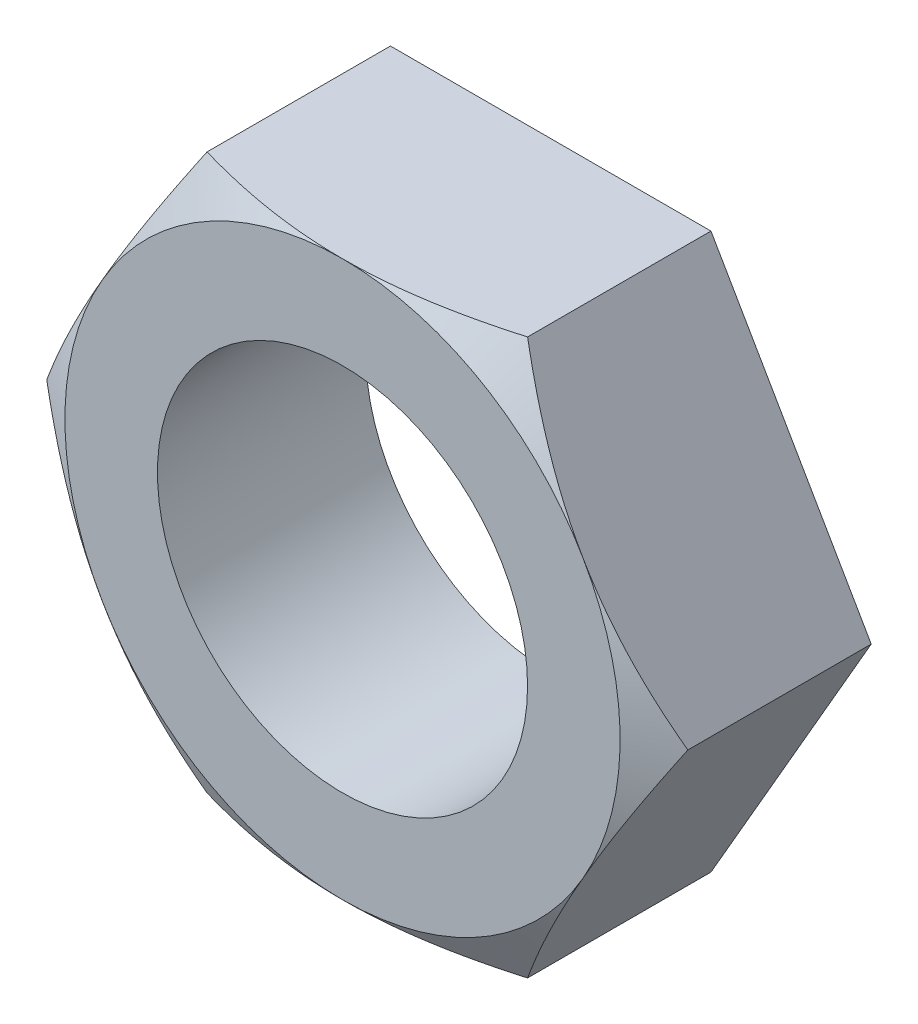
ISO-10303-21;
HEADER;
FILE_DESCRIPTION(('STEP AP214'),'2;1');
FILE_NAME('part.step','',(''),(''),'','','');
FILE_SCHEMA(('AUTOMOTIVE_DESIGN { 1 0 10303 214 1 1 1 1 }'));
ENDSEC;
DATA;
#1=APPLICATION_CONTEXT('core data for automotive mechanical design processes');
#2=APPLICATION_PROTOCOL_DEFINITION('international standard','automotive_design',2000,#1);
#3=PRODUCT_CONTEXT('',#1,'mechanical');
#4=PRODUCT('Part','Part','',(#3));
#5=PRODUCT_RELATED_PRODUCT_CATEGORY('part','',(#4));
#6=PRODUCT_DEFINITION_FORMATION('','',#4);
#7=PRODUCT_DEFINITION_CONTEXT('part definition',#1,'design');
#8=PRODUCT_DEFINITION('design','',#6,#7);
#9=PRODUCT_DEFINITION_SHAPE('','',#8);
#10=(LENGTH_UNIT() NAMED_UNIT(*) SI_UNIT(.MILLI.,.METRE.));
#11=(NAMED_UNIT(*) PLANE_ANGLE_UNIT() SI_UNIT($,.RADIAN.));
#12=(NAMED_UNIT(*) SI_UNIT($,.STERADIAN.) SOLID_ANGLE_UNIT());
#13=UNCERTAINTY_MEASURE_WITH_UNIT(LENGTH_MEASURE(1.E-05),#10,'distance_accuracy_value','');
#14=(GEOMETRIC_REPRESENTATION_CONTEXT(3) GLOBAL_UNCERTAINTY_ASSIGNED_CONTEXT((#13)) GLOBAL_UNIT_ASSIGNED_CONTEXT((#10,
#11,#12)) REPRESENTATION_CONTEXT('',''));
#15=CARTESIAN_POINT('',(0.,0.,0.));
#16=DIRECTION('',(0.,0.,1.));
#17=DIRECTION('',(1.,0.,0.));
#18=AXIS2_PLACEMENT_3D('',#15,#16,#17);
#19=CARTESIAN_POINT('',(-8.24889197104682,14.2875000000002,10.715625));
#20=DIRECTION('',(0.,0.,-1.));
#21=DIRECTION('',(-1.,0.,0.));
#22=AXIS2_PLACEMENT_3D('',#19,#20,#21);
#23=PLANE('',#22);
#24=CARTESIAN_POINT('',(0.,2.22044604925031E-13,10.715625));
#25=DIRECTION('',(0.,0.,1.));
#26=DIRECTION('',(1.,0.,0.));
#27=AXIS2_PLACEMENT_3D('',#24,#25,#26);
#28=CIRCLE('',#27,9.525);
#29=CARTESIAN_POINT('',(9.52499999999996,2.28423809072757E-13,10.715625));
#30=VERTEX_POINT('',#29);
#31=EDGE_CURVE('E174',#30,#30,#28,.T.);
#32=ORIENTED_EDGE('',*,*,#31,.F.);
#33=EDGE_LOOP('',(#32));
#34=FACE_BOUND('',#33,.T.);
#35=CARTESIAN_POINT('',(0.,2.22044604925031E-13,10.715625));
#36=DIRECTION('',(0.,0.,1.));
#37=DIRECTION('',(1.,0.,0.));
#38=AXIS2_PLACEMENT_3D('',#35,#36,#37);
#39=CIRCLE('',#38,14.2875);
#40=CARTESIAN_POINT('',(0.,14.2875000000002,10.715625));
#41=VERTEX_POINT('',#40);
#42=CARTESIAN_POINT('',(-12.3733379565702,7.14375,10.715625));
#43=VERTEX_POINT('',#42);
#44=EDGE_CURVE('E147',#41,#43,#39,.T.);
#45=ORIENTED_EDGE('',*,*,#44,.T.);
#46=CARTESIAN_POINT('',(-12.3733379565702,-7.14374999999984,10.715625));
#47=VERTEX_POINT('',#46);
#48=EDGE_CURVE('E295',#43,#47,#39,.T.);
#49=ORIENTED_EDGE('',*,*,#48,.T.);
#50=CARTESIAN_POINT('',(-1.2490009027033E-13,-14.2874999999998,10.715625));
#51=VERTEX_POINT('',#50);
#52=EDGE_CURVE('E304',#47,#51,#39,.T.);
#53=ORIENTED_EDGE('',*,*,#52,.T.);
#54=CARTESIAN_POINT('',(12.3733379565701,-7.14374999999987,10.715625));
#55=VERTEX_POINT('',#54);
#56=EDGE_CURVE('E47',#51,#55,#39,.T.);
#57=ORIENTED_EDGE('',*,*,#56,.T.);
#58=CARTESIAN_POINT('',(12.3733379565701,7.14375000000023,10.715625));
#59=VERTEX_POINT('',#58);
#60=EDGE_CURVE('E55',#55,#59,#39,.T.);
#61=ORIENTED_EDGE('',*,*,#60,.T.);
#62=EDGE_CURVE('E305',#59,#41,#39,.T.);
#63=ORIENTED_EDGE('',*,*,#62,.T.);
#64=EDGE_LOOP('',(#45,#49,#53,#57,#61,#63));
#65=FACE_BOUND('',#64,.T.);
#66=ADVANCED_FACE('F26',(#34,#65),#23,.F.);
#67=CARTESIAN_POINT('',(-16.4977839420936,1.11022302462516E-13,10.7156250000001));
#68=DIRECTION('',(0.86602540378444,-0.499999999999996,0.));
#69=DIRECTION('',(0.499999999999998,0.86602540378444,0.));
#70=AXIS2_PLACEMENT_3D('',#67,#68,#69);
#71=PLANE('',#70);
#72=CARTESIAN_POINT('',(-8.24877650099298,14.2877000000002,9.43945030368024));
#73=CARTESIAN_POINT('',(-8.43008395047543,13.9736662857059,9.54412145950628));
#74=CARTESIAN_POINT('',(-8.61209859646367,13.6584076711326,9.64404284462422));
#75=CARTESIAN_POINT('',(-8.97758743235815,13.0253624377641,9.8330657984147));
#76=CARTESIAN_POINT('',(-9.16106208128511,12.7075750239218,9.9221638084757));
#77=CARTESIAN_POINT('',(-9.52982551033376,12.0688580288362,10.0883423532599));
#78=CARTESIAN_POINT('',(-9.71511751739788,11.7479228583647,10.1653944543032));
#79=CARTESIAN_POINT('',(-10.0869890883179,11.1038224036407,10.305826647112));
#80=CARTESIAN_POINT('',(-10.2735685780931,10.7806572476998,10.36920751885));
#81=CARTESIAN_POINT('',(-10.6432342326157,10.1403775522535,10.4796014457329));
#82=CARTESIAN_POINT('',(-10.8262929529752,9.82331054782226,10.5269798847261));
#83=CARTESIAN_POINT('',(-11.19324920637,9.1877236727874,10.6064230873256));
#84=CARTESIAN_POINT('',(-11.377146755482,8.86920377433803,10.6384875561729));
#85=CARTESIAN_POINT('',(-11.745250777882,8.23162890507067,10.6864932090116));
#86=CARTESIAN_POINT('',(-11.9294566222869,7.91257502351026,10.7024535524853));
#87=CARTESIAN_POINT('',(-12.2980383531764,7.27417273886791,10.7179077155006));
#88=CARTESIAN_POINT('',(-12.4824142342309,6.95482434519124,10.7174020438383));
#89=CARTESIAN_POINT('',(-12.8271039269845,6.35780428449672,10.7010743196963));
#90=CARTESIAN_POINT('',(-12.9874423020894,6.08009007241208,10.6872438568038));
#91=CARTESIAN_POINT('',(-13.3077502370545,5.52530045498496,10.6473910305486));
#92=CARTESIAN_POINT('',(-13.467719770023,5.24822509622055,10.6213678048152));
#93=CARTESIAN_POINT('',(-13.7872031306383,4.69486368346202,10.5575831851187));
#94=CARTESIAN_POINT('',(-13.9467164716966,4.41857847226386,10.5198120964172));
#95=CARTESIAN_POINT('',(-14.2649953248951,3.86730332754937,10.4331944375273));
#96=CARTESIAN_POINT('',(-14.4237607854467,3.59231348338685,10.3843471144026));
#97=CARTESIAN_POINT('',(-14.9057021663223,2.75756652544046,10.2199559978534));
#98=CARTESIAN_POINT('',(-15.2274824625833,2.20022670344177,10.0880206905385));
#99=CARTESIAN_POINT('',(-15.8662449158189,1.09385768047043,9.78858150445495));
#100=CARTESIAN_POINT('',(-16.1832352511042,0.544814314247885,9.62114795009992));
#101=CARTESIAN_POINT('',(-16.4978994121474,-0.000199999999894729,9.43945030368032));
#102=B_SPLINE_CURVE_WITH_KNOTS('',3,(#72,#73,#74,#75,#76,#77,#78,#79,#80,#81,#82,#83,#84,#85,
#86,#87,#88,#89,#90,#91,#92,#93,#94,#95,#96,#97,#98,#99,#100,#101),.UNSPECIFIED.,.F.,.F.,(4,2,2,
2,2,2,2,2,2,2,2,2,2,2,4),(0.,1.13228866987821,2.26494862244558,3.40024304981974,
4.53547268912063,5.6426821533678,6.74991292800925,7.85582484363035,8.96170258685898,
9.92439507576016,10.8871556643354,11.850712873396,12.8143356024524,14.7839571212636,
16.7497125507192),.UNSPECIFIED.);
#103=CARTESIAN_POINT('',(-8.2488919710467,14.2875000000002,9.43951697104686));
#104=VERTEX_POINT('',#103);
#105=EDGE_CURVE('E144',#104,#43,#102,.T.);
#106=ORIENTED_EDGE('',*,*,#105,.F.);
#107=DIRECTION('',(0.,0.,-1.));
#108=VECTOR('',#107,1.);
#109=CARTESIAN_POINT('',(-8.24889197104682,14.2875000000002,10.715625));
#110=LINE('',#109,#108);
#111=CARTESIAN_POINT('',(-8.24889197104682,14.2875000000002,0.));
#112=VERTEX_POINT('',#111);
#113=EDGE_CURVE('E128',#104,#112,#110,.T.);
#114=ORIENTED_EDGE('',*,*,#113,.T.);
#115=DIRECTION('',(-0.499999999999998,-0.86602540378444,0.));
#116=VECTOR('',#115,1.);
#117=CARTESIAN_POINT('',(-16.4977839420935,1.11022302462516E-13,0.));
#118=LINE('',#117,#116);
#119=CARTESIAN_POINT('',(-16.4977839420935,1.11022302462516E-13,0.));
#120=VERTEX_POINT('',#119);
#121=EDGE_CURVE('E172',#112,#120,#118,.T.);
#122=ORIENTED_EDGE('',*,*,#121,.T.);
#123=DIRECTION('',(0.,0.,-1.));
#124=VECTOR('',#123,1.);
#125=CARTESIAN_POINT('',(-16.4977839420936,1.11022302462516E-13,10.7156250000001));
#126=LINE('',#125,#124);
#127=CARTESIAN_POINT('',(-16.4977839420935,1.11022302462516E-13,9.43951697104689));
#128=VERTEX_POINT('',#127);
#129=EDGE_CURVE('E132',#128,#120,#126,.T.);
#130=ORIENTED_EDGE('',*,*,#129,.F.);
#131=EDGE_CURVE('E155',#43,#128,#102,.T.);
#132=ORIENTED_EDGE('',*,*,#131,.F.);
#133=EDGE_LOOP('',(#106,#114,#122,#130,#132));
#134=FACE_BOUND('',#133,.T.);
#135=ADVANCED_FACE('F28',(#134),#71,.F.);
#136=CARTESIAN_POINT('',(-8.24889197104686,-14.2874999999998,10.715625));
#137=DIRECTION('',(0.86602540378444,0.499999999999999,0.));
#138=DIRECTION('',(-0.499999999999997,0.86602540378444,0.));
#139=AXIS2_PLACEMENT_3D('',#136,#137,#138);
#140=PLANE('',#139);
#141=CARTESIAN_POINT('',(-16.4978994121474,0.000200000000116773,9.43945030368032));
#142=CARTESIAN_POINT('',(-16.3165919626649,-0.313833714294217,9.54412145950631));
#143=CARTESIAN_POINT('',(-16.1345773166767,-0.629092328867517,9.64404284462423));
#144=CARTESIAN_POINT('',(-15.7690884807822,-1.26213756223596,9.83306579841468));
#145=CARTESIAN_POINT('',(-15.5856138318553,-1.57992497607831,9.92216380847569));
#146=CARTESIAN_POINT('',(-15.2168504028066,-2.21864197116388,10.0883423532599));
#147=CARTESIAN_POINT('',(-15.0315583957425,-2.53957714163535,10.1653944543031));
#148=CARTESIAN_POINT('',(-14.6596868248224,-3.18367759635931,10.305826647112));
#149=CARTESIAN_POINT('',(-14.4731073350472,-3.50684275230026,10.36920751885));
#150=CARTESIAN_POINT('',(-14.1034416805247,-4.14712244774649,10.4796014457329));
#151=CARTESIAN_POINT('',(-13.9203829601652,-4.46418945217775,10.5269798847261));
#152=CARTESIAN_POINT('',(-13.5534267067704,-5.09977632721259,10.6064230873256));
#153=CARTESIAN_POINT('',(-13.3695291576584,-5.41829622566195,10.6384875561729));
#154=CARTESIAN_POINT('',(-13.0014251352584,-6.0558710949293,10.6864932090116));
#155=CARTESIAN_POINT('',(-12.8172192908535,-6.3749249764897,10.7024535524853));
#156=CARTESIAN_POINT('',(-12.448637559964,-7.01332726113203,10.7179077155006));
#157=CARTESIAN_POINT('',(-12.2642616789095,-7.33267565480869,10.7174020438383));
#158=CARTESIAN_POINT('',(-11.9195719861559,-7.9296957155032,10.7010743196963));
#159=CARTESIAN_POINT('',(-11.759233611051,-8.20740992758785,10.6872438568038));
#160=CARTESIAN_POINT('',(-11.4389256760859,-8.76219954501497,10.6473910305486));
#161=CARTESIAN_POINT('',(-11.2789561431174,-9.03927490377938,10.6213678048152));
#162=CARTESIAN_POINT('',(-10.9594727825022,-9.59263631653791,10.5575831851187));
#163=CARTESIAN_POINT('',(-10.7999594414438,-9.86892152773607,10.5198120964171));
#164=CARTESIAN_POINT('',(-10.4816805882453,-10.4201966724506,10.4331944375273));
#165=CARTESIAN_POINT('',(-10.3229151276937,-10.6951865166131,10.3843471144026));
#166=CARTESIAN_POINT('',(-9.84097374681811,-11.5299334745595,10.2199559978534));
#167=CARTESIAN_POINT('',(-9.51919345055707,-12.0872732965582,10.0880206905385));
#168=CARTESIAN_POINT('',(-8.88043099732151,-13.1936423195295,9.78858150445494));
#169=CARTESIAN_POINT('',(-8.56344066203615,-13.742685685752,9.62114795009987));
#170=CARTESIAN_POINT('',(-8.24877650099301,-14.2876999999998,9.43945030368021));
#171=B_SPLINE_CURVE_WITH_KNOTS('',3,(#141,#142,#143,#144,#145,#146,#147,#148,#149,#150,#151,
#152,#153,#154,#155,#156,#157,#158,#159,#160,#161,#162,#163,#164,#165,#166,#167,#168,#169,#170),
.UNSPECIFIED.,.F.,.F.,(4,2,2,2,2,2,2,2,2,2,2,2,2,2,4),(0.,1.13228866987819,2.26494862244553,
3.40024304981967,4.53547268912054,5.64268215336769,6.74991292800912,7.8558248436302,
8.96170258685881,9.92439507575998,10.8871556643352,11.8507128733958,12.8143356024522,
14.7839571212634,16.749712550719),.UNSPECIFIED.);
#172=EDGE_CURVE('E182',#128,#47,#171,.T.);
#173=ORIENTED_EDGE('',*,*,#172,.F.);
#174=ORIENTED_EDGE('',*,*,#129,.T.);
#175=DIRECTION('',(0.499999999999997,-0.86602540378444,0.));
#176=VECTOR('',#175,1.);
#177=CARTESIAN_POINT('',(-8.24889197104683,-14.2874999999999,0.));
#178=LINE('',#177,#176);
#179=CARTESIAN_POINT('',(-8.24889197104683,-14.2874999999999,0.));
#180=VERTEX_POINT('',#179);
#181=EDGE_CURVE('E170',#120,#180,#178,.T.);
#182=ORIENTED_EDGE('',*,*,#181,.T.);
#183=DIRECTION('',(0.,0.,-1.));
#184=VECTOR('',#183,1.);
#185=CARTESIAN_POINT('',(-8.24889197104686,-14.2874999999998,10.715625));
#186=LINE('',#185,#184);
#187=CARTESIAN_POINT('',(-8.24889197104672,-14.2874999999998,9.43951697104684));
#188=VERTEX_POINT('',#187);
#189=EDGE_CURVE('E126',#188,#180,#186,.T.);
#190=ORIENTED_EDGE('',*,*,#189,.F.);
#191=EDGE_CURVE('E183',#47,#188,#171,.T.);
#192=ORIENTED_EDGE('',*,*,#191,.F.);
#193=EDGE_LOOP('',(#173,#174,#182,#190,#192));
#194=FACE_BOUND('',#193,.T.);
#195=ADVANCED_FACE('F218',(#194),#140,.F.);
#196=CARTESIAN_POINT('',(8.2488919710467,-14.2874999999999,10.715625));
#197=DIRECTION('',(0.,1.,0.));
#198=DIRECTION('',(0.,0.,1.));
#199=AXIS2_PLACEMENT_3D('',#196,#197,#198);
#200=PLANE('',#199);
#201=CARTESIAN_POINT('',(-21.8772771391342,-14.2874999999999,3.87867469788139));
#202=CARTESIAN_POINT('',(-21.5636377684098,-14.2874999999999,4.0302833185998));
#203=CARTESIAN_POINT('',(-21.249619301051,-14.2874999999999,4.18110729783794));
#204=CARTESIAN_POINT('',(-20.6207440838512,-14.2874999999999,4.48100586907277));
#205=CARTESIAN_POINT('',(-20.3058873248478,-14.2874999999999,4.6300804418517));
#206=CARTESIAN_POINT('',(-19.3598472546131,-14.2874999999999,5.07445309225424));
#207=CARTESIAN_POINT('',(-18.7272961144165,-14.2874999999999,5.36685067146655));
#208=CARTESIAN_POINT('',(-17.4542030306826,-14.2874999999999,5.9436965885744));
#209=CARTESIAN_POINT('',(-16.8136360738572,-14.2874999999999,6.22808986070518));
#210=CARTESIAN_POINT('',(-15.5272379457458,-14.2874999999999,6.78466588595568));
#211=CARTESIAN_POINT('',(-14.8814070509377,-14.2874999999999,7.05684927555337));
#212=CARTESIAN_POINT('',(-13.5754366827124,-14.2874999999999,7.58898224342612));
#213=CARTESIAN_POINT('',(-12.9152188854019,-14.2874999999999,7.84874060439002));
#214=CARTESIAN_POINT('',(-11.5869913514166,-14.2874999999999,8.34791402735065));
#215=CARTESIAN_POINT('',(-10.9189807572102,-14.2874999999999,8.58732682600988));
#216=CARTESIAN_POINT('',(-9.57549889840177,-14.2874999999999,9.03937293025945));
#217=CARTESIAN_POINT('',(-8.90004694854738,-14.2874999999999,9.25206316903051));
#218=CARTESIAN_POINT('',(-7.53947553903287,-14.2874999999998,9.64376711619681));
#219=CARTESIAN_POINT('',(-6.85435921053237,-14.2874999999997,9.82279147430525));
#220=CARTESIAN_POINT('',(-5.81930614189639,-14.2874999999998,10.0595250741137));
#221=CARTESIAN_POINT('',(-5.47298523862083,-14.2874999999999,10.1331478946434));
#222=CARTESIAN_POINT('',(-4.778038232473,-14.2874999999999,10.2686300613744));
#223=CARTESIAN_POINT('',(-4.42941217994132,-14.2874999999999,10.3304896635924));
#224=CARTESIAN_POINT('',(-3.73008200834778,-14.2874999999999,10.4413497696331));
#225=CARTESIAN_POINT('',(-3.37937772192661,-14.2874999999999,10.4903492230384));
#226=CARTESIAN_POINT('',(-2.67631444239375,-14.2874999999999,10.5745014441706));
#227=CARTESIAN_POINT('',(-2.32395551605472,-14.2874999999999,10.609654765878));
#228=CARTESIAN_POINT('',(-1.62031244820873,-14.2874999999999,10.6651718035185));
#229=CARTESIAN_POINT('',(-1.2690356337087,-14.2874999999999,10.6856277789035));
#230=CARTESIAN_POINT('',(-0.565931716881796,-14.2874999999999,10.711641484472));
#231=CARTESIAN_POINT('',(-0.214104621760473,-14.2874999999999,10.7171994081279));
#232=CARTESIAN_POINT('',(0.48936855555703,-14.2874999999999,10.7132851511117));
#233=CARTESIAN_POINT('',(0.841014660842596,-14.2874999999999,10.7038171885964));
#234=CARTESIAN_POINT('',(1.54360125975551,-14.2874999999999,10.670086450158));
#235=CARTESIAN_POINT('',(1.89454171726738,-14.2874999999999,10.6458229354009));
#236=CARTESIAN_POINT('',(2.74511336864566,-14.2874999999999,10.5695915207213));
#237=CARTESIAN_POINT('',(3.24409106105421,-14.2874999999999,10.5102105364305));
#238=CARTESIAN_POINT('',(4.23822277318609,-14.2874999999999,10.3648341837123));
#239=CARTESIAN_POINT('',(4.73337571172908,-14.2874999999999,10.278831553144));
#240=CARTESIAN_POINT('',(5.71944950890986,-14.2874999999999,10.0832620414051));
#241=CARTESIAN_POINT('',(6.21036590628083,-14.2874999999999,9.97367287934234));
#242=CARTESIAN_POINT('',(7.18714781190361,-14.2874999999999,9.73427438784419));
#243=CARTESIAN_POINT('',(7.6730137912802,-14.2874999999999,9.60446696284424));
#244=CARTESIAN_POINT('',(8.65166193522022,-14.2874999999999,9.32434282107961));
#245=CARTESIAN_POINT('',(9.14432169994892,-14.2874999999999,9.17360137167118));
#246=CARTESIAN_POINT('',(10.1244328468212,-14.2874999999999,8.85722891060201));
#247=CARTESIAN_POINT('',(10.6118875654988,-14.2874999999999,8.69160816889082));
#248=CARTESIAN_POINT('',(11.5796371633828,-14.2874999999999,8.34887715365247));
#249=CARTESIAN_POINT('',(12.0599568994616,-14.2874999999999,8.17183679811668));
#250=CARTESIAN_POINT('',(12.7775886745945,-14.2874999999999,7.89854598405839));
#251=CARTESIAN_POINT('',(13.0163757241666,-14.2874999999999,7.80613994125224));
#252=CARTESIAN_POINT('',(13.4930210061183,-14.2874999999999,7.61897774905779));
#253=CARTESIAN_POINT('',(13.7308792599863,-14.2874999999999,7.5242216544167));
#254=CARTESIAN_POINT('',(13.9683064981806,-14.2874999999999,7.42839626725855));
#255=B_SPLINE_CURVE_WITH_KNOTS('',3,(#201,#202,#203,#204,#205,#206,#207,#208,#209,#210,#211,
#212,#213,#214,#215,#216,#217,#218,#219,#220,#221,#222,#223,#224,#225,#226,#227,#228,#229,#230,
#231,#232,#233,#234,#235,#236,#237,#238,#239,#240,#241,#242,#243,#244,#245,#246,#247,#248,#249,
#250,#251,#252,#253,#254),.UNSPECIFIED.,.F.,.F.,(4,2,2,2,2,2,2,2,2,2,2,2,2,2,2,2,2,2,2,2,2,2,2,
2,2,2,4),(0.,1.04507856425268,2.09016859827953,4.180688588,6.2831717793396,8.3855452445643,
10.513729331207,12.6421498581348,14.7659559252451,16.8890890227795,17.9511013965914,
19.0130906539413,20.0751666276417,21.1372001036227,22.1925072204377,23.2478006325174,
24.3027978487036,25.3578477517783,26.8645039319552,28.3715714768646,29.8800689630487,
31.3884244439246,32.9337529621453,34.4780229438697,36.0136007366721,36.7817204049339,
37.5498221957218),.UNSPECIFIED.);
#256=EDGE_CURVE('E214',#188,#51,#255,.T.);
#257=ORIENTED_EDGE('',*,*,#256,.F.);
#258=ORIENTED_EDGE('',*,*,#189,.T.);
#259=DIRECTION('',(1.,0.,0.));
#260=VECTOR('',#259,1.);
#261=CARTESIAN_POINT('',(8.24889197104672,-14.2874999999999,0.));
#262=LINE('',#261,#260);
#263=CARTESIAN_POINT('',(8.24889197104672,-14.2874999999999,0.));
#264=VERTEX_POINT('',#263);
#265=EDGE_CURVE('E167',#180,#264,#262,.T.);
#266=ORIENTED_EDGE('',*,*,#265,.T.);
#267=DIRECTION('',(0.,0.,-1.));
#268=VECTOR('',#267,1.);
#269=CARTESIAN_POINT('',(8.2488919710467,-14.2874999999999,10.715625));
#270=LINE('',#269,#268);
#271=CARTESIAN_POINT('',(8.24889197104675,-14.2874999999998,9.43951697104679));
#272=VERTEX_POINT('',#271);
#273=EDGE_CURVE('E123',#272,#264,#270,.T.);
#274=ORIENTED_EDGE('',*,*,#273,.F.);
#275=EDGE_CURVE('E209',#51,#272,#255,.T.);
#276=ORIENTED_EDGE('',*,*,#275,.F.);
#277=EDGE_LOOP('',(#257,#258,#266,#274,#276));
#278=FACE_BOUND('',#277,.T.);
#279=ADVANCED_FACE('F215',(#278),#200,.F.);
#280=CARTESIAN_POINT('',(16.4977839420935,1.11022302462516E-13,10.715625));
#281=DIRECTION('',(-0.86602540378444,0.499999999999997,0.));
#282=DIRECTION('',(-0.499999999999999,-0.86602540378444,0.));
#283=AXIS2_PLACEMENT_3D('',#280,#281,#282);
#284=PLANE('',#283);
#285=CARTESIAN_POINT('',(8.24877650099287,-14.2876999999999,9.43945030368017));
#286=CARTESIAN_POINT('',(8.43008395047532,-13.9736662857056,9.54412145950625));
#287=CARTESIAN_POINT('',(8.61209859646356,-13.6584076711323,9.64404284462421));
#288=CARTESIAN_POINT('',(8.97758743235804,-13.0253624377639,9.8330657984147));
#289=CARTESIAN_POINT('',(9.161062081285,-12.7075750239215,9.9221638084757));
#290=CARTESIAN_POINT('',(9.52982551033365,-12.0688580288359,10.0883423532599));
#291=CARTESIAN_POINT('',(9.71511751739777,-11.7479228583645,10.1653944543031));
#292=CARTESIAN_POINT('',(10.0869890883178,-11.1038224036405,10.305826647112));
#293=CARTESIAN_POINT('',(10.273568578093,-10.7806572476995,10.36920751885));
#294=CARTESIAN_POINT('',(10.6432342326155,-10.1403775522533,10.4796014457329));
#295=CARTESIAN_POINT('',(10.8262929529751,-9.82331054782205,10.5269798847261));
#296=CARTESIAN_POINT('',(11.1932492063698,-9.1877236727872,10.6064230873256));
#297=CARTESIAN_POINT('',(11.3771467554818,-8.86920377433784,10.6384875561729));
#298=CARTESIAN_POINT('',(11.7452507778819,-8.23162890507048,10.6864932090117));
#299=CARTESIAN_POINT('',(11.9294566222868,-7.91257502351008,10.7024535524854));
#300=CARTESIAN_POINT('',(12.2980383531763,-7.27417273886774,10.7179077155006));
#301=CARTESIAN_POINT('',(12.4824142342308,-6.95482434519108,10.7174020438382));
#302=CARTESIAN_POINT('',(12.8271039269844,-6.35780428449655,10.7010743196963));
#303=CARTESIAN_POINT('',(12.9874423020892,-6.08009007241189,10.6872438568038));
#304=CARTESIAN_POINT('',(13.3077502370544,-5.52530045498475,10.6473910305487));
#305=CARTESIAN_POINT('',(13.4677197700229,-5.24822509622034,10.6213678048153));
#306=CARTESIAN_POINT('',(13.7872031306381,-4.69486368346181,10.5575831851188));
#307=CARTESIAN_POINT('',(13.9467164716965,-4.41857847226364,10.5198120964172));
#308=CARTESIAN_POINT('',(14.264995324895,-3.86730332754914,10.4331944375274));
#309=CARTESIAN_POINT('',(14.4237607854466,-3.59231348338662,10.3843471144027));
#310=CARTESIAN_POINT('',(14.9057021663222,-2.75756652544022,10.2199559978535));
#311=CARTESIAN_POINT('',(15.2274824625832,-2.20022670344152,10.0880206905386));
#312=CARTESIAN_POINT('',(15.8662449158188,-1.09385768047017,9.78858150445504));
#313=CARTESIAN_POINT('',(16.1832352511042,-0.54481431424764,9.62114795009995));
#314=CARTESIAN_POINT('',(16.4978994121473,0.000200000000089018,9.43945030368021));
#315=B_SPLINE_CURVE_WITH_KNOTS('',3,(#285,#286,#287,#288,#289,#290,#291,#292,#293,#294,#295,
#296,#297,#298,#299,#300,#301,#302,#303,#304,#305,#306,#307,#308,#309,#310,#311,#312,#313,#314),
.UNSPECIFIED.,.F.,.F.,(4,2,2,2,2,2,2,2,2,2,2,2,2,2,4),(0.,1.13228866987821,2.26494862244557,
3.40024304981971,4.53547268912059,5.64268215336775,6.74991292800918,7.85582484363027,
8.96170258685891,9.9243950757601,10.8871556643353,11.850712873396,12.8143356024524,
14.7839571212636,16.7497125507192),.UNSPECIFIED.);
#316=EDGE_CURVE('E109',#272,#55,#315,.T.);
#317=ORIENTED_EDGE('',*,*,#316,.F.);
#318=ORIENTED_EDGE('',*,*,#273,.T.);
#319=DIRECTION('',(0.499999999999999,0.86602540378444,0.));
#320=VECTOR('',#319,1.);
#321=CARTESIAN_POINT('',(16.4977839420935,1.11022302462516E-13,0.));
#322=LINE('',#321,#320);
#323=CARTESIAN_POINT('',(16.4977839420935,1.11022302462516E-13,0.));
#324=VERTEX_POINT('',#323);
#325=EDGE_CURVE('E121',#264,#324,#322,.T.);
#326=ORIENTED_EDGE('',*,*,#325,.T.);
#327=DIRECTION('',(0.,0.,-1.));
#328=VECTOR('',#327,1.);
#329=CARTESIAN_POINT('',(16.4977839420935,1.11022302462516E-13,10.715625));
#330=LINE('',#329,#328);
#331=CARTESIAN_POINT('',(16.4977839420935,1.38777878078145E-13,9.43951697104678));
#332=VERTEX_POINT('',#331);
#333=EDGE_CURVE('E114',#332,#324,#330,.T.);
#334=ORIENTED_EDGE('',*,*,#333,.F.);
#335=EDGE_CURVE('E101',#55,#332,#315,.T.);
#336=ORIENTED_EDGE('',*,*,#335,.F.);
#337=EDGE_LOOP('',(#317,#318,#326,#334,#336));
#338=FACE_BOUND('',#337,.T.);
#339=ADVANCED_FACE('F119',(#338),#284,.F.);
#340=CARTESIAN_POINT('',(8.24889197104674,14.2875000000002,10.715625));
#341=DIRECTION('',(-0.86602540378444,-0.499999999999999,0.));
#342=DIRECTION('',(0.499999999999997,-0.86602540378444,0.));
#343=AXIS2_PLACEMENT_3D('',#340,#341,#342);
#344=PLANE('',#343);
#345=CARTESIAN_POINT('',(16.4978994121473,-0.000199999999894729,9.43945030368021));
#346=CARTESIAN_POINT('',(16.3165919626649,0.31383371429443,9.54412145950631));
#347=CARTESIAN_POINT('',(16.1345773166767,0.629092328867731,9.64404284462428));
#348=CARTESIAN_POINT('',(15.7690884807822,1.26213756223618,9.83306579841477));
#349=CARTESIAN_POINT('',(15.5856138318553,1.57992497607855,9.92216380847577));
#350=CARTESIAN_POINT('',(15.2168504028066,2.21864197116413,10.08834235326));
#351=CARTESIAN_POINT('',(15.0315583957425,2.53957714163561,10.1653944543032));
#352=CARTESIAN_POINT('',(14.6596868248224,3.18367759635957,10.3058266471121));
#353=CARTESIAN_POINT('',(14.4731073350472,3.50684275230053,10.3692075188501));
#354=CARTESIAN_POINT('',(14.1034416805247,4.14712244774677,10.479601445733));
#355=CARTESIAN_POINT('',(13.9203829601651,4.46418945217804,10.5269798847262));
#356=CARTESIAN_POINT('',(13.5534267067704,5.0997763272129,10.6064230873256));
#357=CARTESIAN_POINT('',(13.3695291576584,5.41829622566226,10.6384875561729));
#358=CARTESIAN_POINT('',(13.0014251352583,6.05587109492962,10.6864932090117));
#359=CARTESIAN_POINT('',(12.8172192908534,6.37492497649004,10.7024535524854));
#360=CARTESIAN_POINT('',(12.4486375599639,7.01332726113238,10.7179077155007));
#361=CARTESIAN_POINT('',(12.2642616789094,7.33267565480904,10.7174020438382));
#362=CARTESIAN_POINT('',(11.9195719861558,7.92969571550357,10.7010743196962));
#363=CARTESIAN_POINT('',(11.759233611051,8.20740992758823,10.6872438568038));
#364=CARTESIAN_POINT('',(11.4389256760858,8.76219954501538,10.6473910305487));
#365=CARTESIAN_POINT('',(11.2789561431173,9.03927490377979,10.6213678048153));
#366=CARTESIAN_POINT('',(10.9594727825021,9.59263631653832,10.5575831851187));
#367=CARTESIAN_POINT('',(10.7999594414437,9.86892152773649,10.5198120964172));
#368=CARTESIAN_POINT('',(10.4816805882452,10.420196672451,10.4331944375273));
#369=CARTESIAN_POINT('',(10.3229151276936,10.6951865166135,10.3843471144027));
#370=CARTESIAN_POINT('',(9.840973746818,11.5299334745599,10.2199559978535));
#371=CARTESIAN_POINT('',(9.51919345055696,12.0872732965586,10.0880206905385));
#372=CARTESIAN_POINT('',(8.88043099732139,13.1936423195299,9.78858150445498));
#373=CARTESIAN_POINT('',(8.56344066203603,13.7426856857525,9.62114795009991));
#374=CARTESIAN_POINT('',(8.2487765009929,14.2877000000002,9.43945030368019));
#375=B_SPLINE_CURVE_WITH_KNOTS('',3,(#345,#346,#347,#348,#349,#350,#351,#352,#353,#354,#355,
#356,#357,#358,#359,#360,#361,#362,#363,#364,#365,#366,#367,#368,#369,#370,#371,#372,#373,#374),
.UNSPECIFIED.,.F.,.F.,(4,2,2,2,2,2,2,2,2,2,2,2,2,2,4),(0.,1.13228866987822,2.2649486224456,
3.40024304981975,4.53547268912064,5.64268215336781,6.74991292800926,7.85582484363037,
8.96170258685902,9.92439507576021,10.8871556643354,11.8507128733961,12.8143356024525,
14.7839571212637,16.7497125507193),.UNSPECIFIED.);
#376=EDGE_CURVE('E104',#332,#59,#375,.T.);
#377=ORIENTED_EDGE('',*,*,#376,.F.);
#378=ORIENTED_EDGE('',*,*,#333,.T.);
#379=DIRECTION('',(-0.499999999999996,0.86602540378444,0.));
#380=VECTOR('',#379,1.);
#381=CARTESIAN_POINT('',(8.24889197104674,14.2875000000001,0.));
#382=LINE('',#381,#380);
#383=CARTESIAN_POINT('',(8.24889197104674,14.2875000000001,0.));
#384=VERTEX_POINT('',#383);
#385=EDGE_CURVE('E162',#324,#384,#382,.T.);
#386=ORIENTED_EDGE('',*,*,#385,.T.);
#387=DIRECTION('',(0.,0.,-1.));
#388=VECTOR('',#387,1.);
#389=CARTESIAN_POINT('',(8.24889197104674,14.2875000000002,10.715625));
#390=LINE('',#389,#388);
#391=CARTESIAN_POINT('',(8.24889197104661,14.2875000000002,9.43951697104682));
#392=VERTEX_POINT('',#391);
#393=EDGE_CURVE('E124',#392,#384,#390,.T.);
#394=ORIENTED_EDGE('',*,*,#393,.F.);
#395=EDGE_CURVE('E117',#59,#392,#375,.T.);
#396=ORIENTED_EDGE('',*,*,#395,.F.);
#397=EDGE_LOOP('',(#377,#378,#386,#394,#396));
#398=FACE_BOUND('',#397,.T.);
#399=ADVANCED_FACE('F112',(#398),#344,.F.);
#400=CARTESIAN_POINT('',(-8.24889197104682,14.2875000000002,10.715625));
#401=DIRECTION('',(0.,-1.,0.));
#402=DIRECTION('',(0.,0.,-1.));
#403=AXIS2_PLACEMENT_3D('',#400,#401,#402);
#404=PLANE('',#403);
#405=CARTESIAN_POINT('',(-21.8772771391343,14.2875000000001,3.87867469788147));
#406=CARTESIAN_POINT('',(-21.5636377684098,14.2875000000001,4.03028331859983));
#407=CARTESIAN_POINT('',(-21.2496193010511,14.2875000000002,4.18110729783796));
#408=CARTESIAN_POINT('',(-20.6207440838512,14.2875000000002,4.48100586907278));
#409=CARTESIAN_POINT('',(-20.3058873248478,14.2875000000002,4.63008044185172));
#410=CARTESIAN_POINT('',(-19.3598472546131,14.2875000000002,5.07445309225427));
#411=CARTESIAN_POINT('',(-18.7272961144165,14.2875000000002,5.36685067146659));
#412=CARTESIAN_POINT('',(-17.4542030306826,14.2875000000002,5.94369658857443));
#413=CARTESIAN_POINT('',(-16.8136360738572,14.2875000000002,6.22808986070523));
#414=CARTESIAN_POINT('',(-15.5272379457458,14.2875000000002,6.78466588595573));
#415=CARTESIAN_POINT('',(-14.8814070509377,14.2875000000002,7.05684927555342));
#416=CARTESIAN_POINT('',(-13.5754366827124,14.2875000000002,7.58898224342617));
#417=CARTESIAN_POINT('',(-12.9152188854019,14.2875000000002,7.84874060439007));
#418=CARTESIAN_POINT('',(-11.5869913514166,14.2875000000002,8.34791402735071));
#419=CARTESIAN_POINT('',(-10.9189807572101,14.2875000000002,8.58732682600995));
#420=CARTESIAN_POINT('',(-9.57549889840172,14.2875000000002,9.03937293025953));
#421=CARTESIAN_POINT('',(-8.90004694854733,14.2875000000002,9.25206316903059));
#422=CARTESIAN_POINT('',(-7.5394755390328,14.2875000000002,9.64376711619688));
#423=CARTESIAN_POINT('',(-6.85435921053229,14.2875000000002,9.82279147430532));
#424=CARTESIAN_POINT('',(-5.81930614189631,14.2875000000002,10.0595250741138));
#425=CARTESIAN_POINT('',(-5.47298523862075,14.2875000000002,10.1331478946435));
#426=CARTESIAN_POINT('',(-4.77803823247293,14.2875000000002,10.2686300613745));
#427=CARTESIAN_POINT('',(-4.42941217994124,14.2875000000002,10.3304896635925));
#428=CARTESIAN_POINT('',(-3.7300820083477,14.2875000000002,10.4413497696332));
#429=CARTESIAN_POINT('',(-3.37937772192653,14.2875000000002,10.4903492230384));
#430=CARTESIAN_POINT('',(-2.67631444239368,14.2875000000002,10.5745014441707));
#431=CARTESIAN_POINT('',(-2.32395551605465,14.2875000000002,10.6096547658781));
#432=CARTESIAN_POINT('',(-1.62031244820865,14.2875000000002,10.6651718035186));
#433=CARTESIAN_POINT('',(-1.26903563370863,14.2875000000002,10.6856277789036));
#434=CARTESIAN_POINT('',(-0.565931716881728,14.2875000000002,10.7116414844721));
#435=CARTESIAN_POINT('',(-0.214104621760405,14.2875000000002,10.717199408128));
#436=CARTESIAN_POINT('',(0.4893685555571,14.2875000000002,10.7132851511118));
#437=CARTESIAN_POINT('',(0.841014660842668,14.2875000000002,10.7038171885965));
#438=CARTESIAN_POINT('',(1.54360125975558,14.2875000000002,10.6700864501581));
#439=CARTESIAN_POINT('',(1.89454171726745,14.2875000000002,10.6458229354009));
#440=CARTESIAN_POINT('',(2.74511336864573,14.2875000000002,10.5695915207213));
#441=CARTESIAN_POINT('',(3.24409106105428,14.2875000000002,10.5102105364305));
#442=CARTESIAN_POINT('',(4.23822277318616,14.2875000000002,10.3648341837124));
#443=CARTESIAN_POINT('',(4.73337571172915,14.2875000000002,10.2788315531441));
#444=CARTESIAN_POINT('',(5.71944950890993,14.2875000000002,10.0832620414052));
#445=CARTESIAN_POINT('',(6.21036590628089,14.2875000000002,9.9736728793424));
#446=CARTESIAN_POINT('',(7.18714781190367,14.2875000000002,9.73427438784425));
#447=CARTESIAN_POINT('',(7.67301379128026,14.2875000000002,9.6044669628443));
#448=CARTESIAN_POINT('',(8.65166193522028,14.2875000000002,9.32434282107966));
#449=CARTESIAN_POINT('',(9.14432169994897,14.2875000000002,9.17360137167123));
#450=CARTESIAN_POINT('',(10.1244328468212,14.2875000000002,8.85722891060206));
#451=CARTESIAN_POINT('',(10.6118875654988,14.2875000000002,8.69160816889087));
#452=CARTESIAN_POINT('',(11.5796371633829,14.2875000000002,8.34887715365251));
#453=CARTESIAN_POINT('',(12.0599568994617,14.2875000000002,8.17183679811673));
#454=CARTESIAN_POINT('',(12.7775886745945,14.2875000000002,7.89854598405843));
#455=CARTESIAN_POINT('',(13.0163757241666,14.2875000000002,7.8061399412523));
#456=CARTESIAN_POINT('',(13.4930210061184,14.2875000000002,7.61897774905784));
#457=CARTESIAN_POINT('',(13.7308792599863,14.2875000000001,7.52422165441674));
#458=CARTESIAN_POINT('',(13.9683064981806,14.2875000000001,7.42839626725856));
#459=B_SPLINE_CURVE_WITH_KNOTS('',3,(#405,#406,#407,#408,#409,#410,#411,#412,#413,#414,#415,
#416,#417,#418,#419,#420,#421,#422,#423,#424,#425,#426,#427,#428,#429,#430,#431,#432,#433,#434,
#435,#436,#437,#438,#439,#440,#441,#442,#443,#444,#445,#446,#447,#448,#449,#450,#451,#452,#453,
#454,#455,#456,#457,#458),.UNSPECIFIED.,.F.,.F.,(4,2,2,2,2,2,2,2,2,2,2,2,2,2,2,2,2,2,2,2,2,2,2,
2,2,2,4),(0.,1.04507856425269,2.09016859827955,4.18068858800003,6.28317177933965,
8.38554524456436,10.5137293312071,12.6421498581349,14.7659559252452,16.8890890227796,
17.9511013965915,19.0130906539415,20.0751666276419,21.1372001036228,22.1925072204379,
23.2478006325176,24.3027978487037,25.3578477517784,26.8645039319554,28.3715714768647,
29.8800689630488,31.3884244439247,32.9337529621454,34.4780229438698,36.0136007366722,
36.7817204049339,37.5498221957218),.UNSPECIFIED.);
#460=EDGE_CURVE('E11',#392,#41,#459,.F.);
#461=ORIENTED_EDGE('',*,*,#460,.F.);
#462=ORIENTED_EDGE('',*,*,#393,.T.);
#463=DIRECTION('',(-1.,0.,0.));
#464=VECTOR('',#463,1.);
#465=CARTESIAN_POINT('',(-8.24889197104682,14.2875000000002,0.));
#466=LINE('',#465,#464);
#467=EDGE_CURVE('E160',#384,#112,#466,.T.);
#468=ORIENTED_EDGE('',*,*,#467,.T.);
#469=ORIENTED_EDGE('',*,*,#113,.F.);
#470=EDGE_CURVE('E31',#41,#104,#459,.F.);
#471=ORIENTED_EDGE('',*,*,#470,.F.);
#472=EDGE_LOOP('',(#461,#462,#468,#469,#471));
#473=FACE_BOUND('',#472,.T.);
#474=ADVANCED_FACE('F158',(#473),#404,.F.);
#475=CARTESIAN_POINT('',(-8.24889197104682,14.2875000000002,0.));
#476=DIRECTION('',(0.,0.,-1.));
#477=DIRECTION('',(-1.,0.,0.));
#478=AXIS2_PLACEMENT_3D('',#475,#476,#477);
#479=PLANE('',#478);
#480=ORIENTED_EDGE('',*,*,#121,.F.);
#481=ORIENTED_EDGE('',*,*,#467,.F.);
#482=ORIENTED_EDGE('',*,*,#385,.F.);
#483=ORIENTED_EDGE('',*,*,#325,.F.);
#484=ORIENTED_EDGE('',*,*,#265,.F.);
#485=ORIENTED_EDGE('',*,*,#181,.F.);
#486=EDGE_LOOP('',(#480,#481,#482,#483,#484,#485));
#487=FACE_BOUND('',#486,.T.);
#488=CARTESIAN_POINT('',(0.,1.11022302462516E-13,0.));
#489=DIRECTION('',(0.,0.,1.));
#490=DIRECTION('',(1.,0.,0.));
#491=AXIS2_PLACEMENT_3D('',#488,#489,#490);
#492=CIRCLE('',#491,9.525);
#493=CARTESIAN_POINT('',(9.525,1.17401506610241E-13,0.));
#494=VERTEX_POINT('',#493);
#495=EDGE_CURVE('E156',#494,#494,#492,.T.);
#496=ORIENTED_EDGE('',*,*,#495,.T.);
#497=EDGE_LOOP('',(#496));
#498=FACE_BOUND('',#497,.T.);
#499=ADVANCED_FACE('F233',(#487,#498),#479,.T.);
#500=CARTESIAN_POINT('',(0.,2.22044604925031E-13,10.715625));
#501=DIRECTION('',(0.,0.,-1.));
#502=DIRECTION('',(-1.,0.,0.));
#503=AXIS2_PLACEMENT_3D('',#500,#501,#502);
#504=CYLINDRICAL_SURFACE('',#503,9.525);
#505=ORIENTED_EDGE('',*,*,#31,.T.);
#506=EDGE_LOOP('',(#505));
#507=FACE_BOUND('',#506,.T.);
#508=ORIENTED_EDGE('',*,*,#495,.F.);
#509=EDGE_LOOP('',(#508));
#510=FACE_BOUND('',#509,.T.);
#511=ADVANCED_FACE('F192',(#507,#510),#504,.F.);
#512=CARTESIAN_POINT('',(0.,2.22044604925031E-13,10.715625));
#513=DIRECTION('',(0.,0.,-1.));
#514=DIRECTION('',(-1.,0.,0.));
#515=AXIS2_PLACEMENT_3D('',#512,#513,#514);
#516=CONICAL_SURFACE('',#515,14.2875,1.04719755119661);
#517=ORIENTED_EDGE('',*,*,#105,.T.);
#518=ORIENTED_EDGE('',*,*,#44,.F.);
#519=ORIENTED_EDGE('',*,*,#470,.T.);
#520=EDGE_LOOP('',(#517,#518,#519));
#521=FACE_BOUND('',#520,.T.);
#522=ADVANCED_FACE('F143',(#521),#516,.T.);
#523=ORIENTED_EDGE('',*,*,#395,.T.);
#524=ORIENTED_EDGE('',*,*,#460,.T.);
#525=ORIENTED_EDGE('',*,*,#62,.F.);
#526=EDGE_LOOP('',(#523,#524,#525));
#527=FACE_BOUND('',#526,.T.);
#528=ADVANCED_FACE('F191',(#527),#516,.T.);
#529=ORIENTED_EDGE('',*,*,#335,.T.);
#530=ORIENTED_EDGE('',*,*,#376,.T.);
#531=ORIENTED_EDGE('',*,*,#60,.F.);
#532=EDGE_LOOP('',(#529,#530,#531));
#533=FACE_BOUND('',#532,.T.);
#534=ADVANCED_FACE('F103',(#533),#516,.T.);
#535=ORIENTED_EDGE('',*,*,#275,.T.);
#536=ORIENTED_EDGE('',*,*,#316,.T.);
#537=ORIENTED_EDGE('',*,*,#56,.F.);
#538=EDGE_LOOP('',(#535,#536,#537));
#539=FACE_BOUND('',#538,.T.);
#540=ADVANCED_FACE('F273',(#539),#516,.T.);
#541=ORIENTED_EDGE('',*,*,#191,.T.);
#542=ORIENTED_EDGE('',*,*,#256,.T.);
#543=ORIENTED_EDGE('',*,*,#52,.F.);
#544=EDGE_LOOP('',(#541,#542,#543));
#545=FACE_BOUND('',#544,.T.);
#546=ADVANCED_FACE('F279',(#545),#516,.T.);
#547=ORIENTED_EDGE('',*,*,#131,.T.);
#548=ORIENTED_EDGE('',*,*,#172,.T.);
#549=ORIENTED_EDGE('',*,*,#48,.F.);
#550=EDGE_LOOP('',(#547,#548,#549));
#551=FACE_BOUND('',#550,.T.);
#552=ADVANCED_FACE('F193',(#551),#516,.T.);
#553=CLOSED_SHELL('',(#66,#135,#195,#279,#339,#399,#474,#499,#511,#522,#528,#534,#540,#546,#552));
#554=MANIFOLD_SOLID_BREP('B2',#553);
#555=ADVANCED_BREP_SHAPE_REPRESENTATION('',(#18,#554),#14);
#556=SHAPE_DEFINITION_REPRESENTATION(#9,#555);
ENDSEC;
END-ISO-10303-21;
